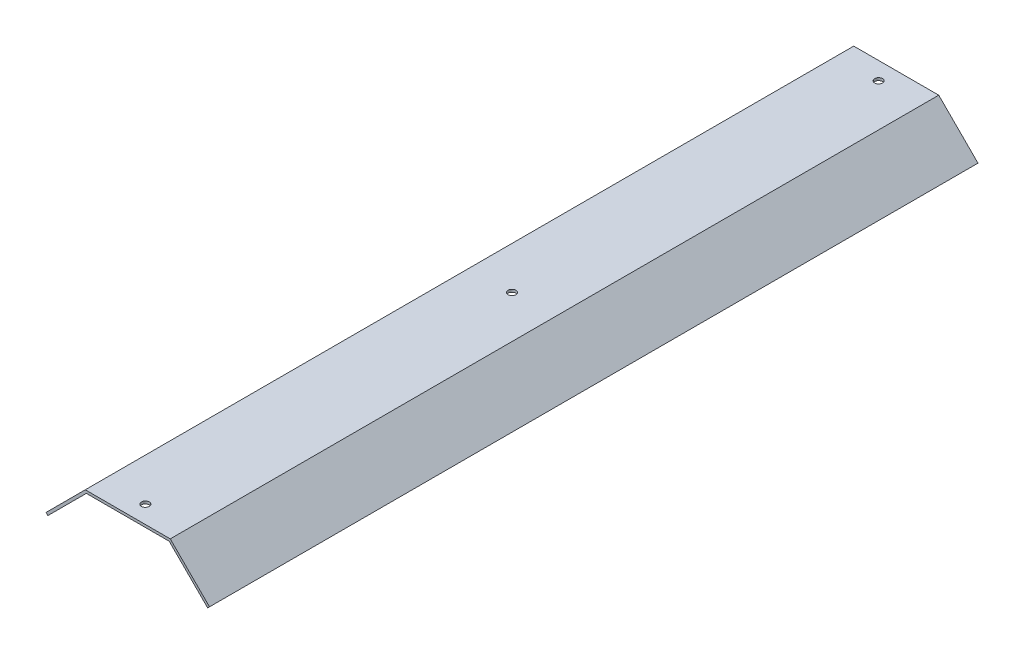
from build123d import *

# Parameters (mm, degrees)
BOSS_EXTRU_1_DEPTH      = 443
ESQUISSE2_R             = 2.25
ENL_V_MAT_EXTRU_1_DEPTH = 10


with BuildPart() as part:
    # Esquisse1 → Boss.-Extru.1 (new body)
    with BuildSketch(Plane.XY):
        Polygon((24.5, 17.5), (-24.5, 17.5), (-47.127416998, -5.127416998), (-46.066756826, -6.18807717), (-23.878679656, 16), (23.878679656, 16), (46.066756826, -6.18807717), (47.127416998, -5.127416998), align=None)
    extrude(amount=BOSS_EXTRU_1_DEPTH)

    # Esquisse2 → Enl_v. mat.-Extru.1 (cut)
    with BuildSketch(Plane(origin=(0, 17.5, 0), x_dir=(1, 0, 0), z_dir=(0, 1, 0))):
        with Locations(Location((0, -10.15, 0), (0, 0, 180))):
            Circle(ESQUISSE2_R)
        with Locations(Location((0, -221.5, 0), (0, 0, 180))):
            Circle(ESQUISSE2_R)
        with Locations(Location((0, -432.85, 0), (0, 0, 180))):
            Circle(ESQUISSE2_R)
    extrude(amount=-ENL_V_MAT_EXTRU_1_DEPTH, mode=Mode.SUBTRACT)


solid = part.part
